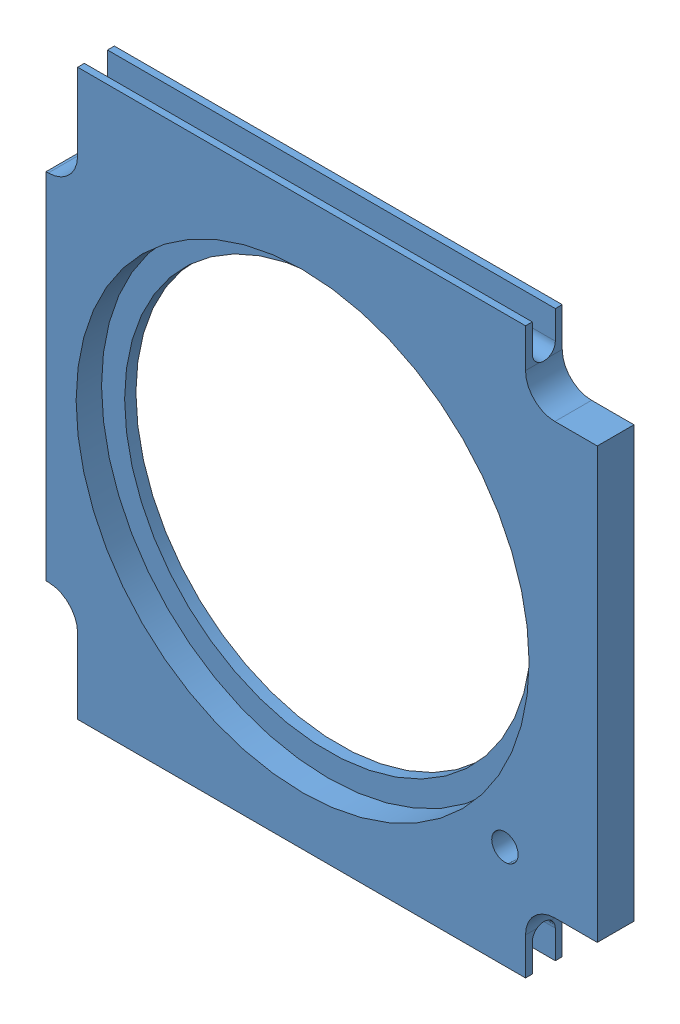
SolidWorks assembly Fixture-undercut-part.SLDASM, configuration No clamps (file format 13000). Lengths in mm.
Overall size (123.95 127 8.26).
13 component instances, 4 part files, 8 mates.
Components (placement in the parent):
- Fixture-undercut-part-1: Fixture-undercut-part.SLDPRT [Default] at (57.186 0 0) x (0 0 1) z (-1 0 0) size (8.26 127 123.95)
- Short-clamp-toe-2: Short-clamp-toe.SLDPRT [Default] at (59.2079 6.7742 10.9361) x (0 1 0) z (0 0 1) size (61.72 24.71 12.45) (suppressed, hidden)
- Short-clamp-toe-4: Short-clamp-toe.SLDPRT [Default] at (59.2177 -2.1506 11.0836) x (0 -1 0) z (0 0 1) size (61.72 24.71 12.45) (suppressed, hidden)
- Short-clamp-wedge-2: Short-clamp-wedge.SLDPRT [Default] at (46.6068 0.0427 -5.5453) x (0 0.038151 0.999272) z (1 0 0) size (29.14 19.72 25.4) (suppressed, hidden)
- Short-clamp-wedge-3: Short-clamp-wedge.SLDPRT [Default] at (72.2619 4.7581 -5.3977) x (0 -0.038151 0.999272) z (-1 0 0) size (29.14 19.72 25.4) (suppressed, hidden)
- Short-clamp-bolt-3: Short-clamp-bolt.SLDPRT [Default] at (-10.9915 73.142 23.3821) size (13.89 13.89 76.2) (suppressed, hidden)
- Short-clamp-bolt-4: Short-clamp-bolt.SLDPRT [Default] at (-11.4778 -66.3426 23.5296) size (13.89 13.89 76.2) (suppressed, hidden)
- Short-clamp-toe-1: Short-clamp-toe.SLDPRT [Default] at (63.63 1.5156 8.3277) size (61.72 24.71 12.45) (suppressed, hidden)
- Short-clamp-toe-3: Short-clamp-toe.SLDPRT [Default] at (57.6843 1.1605 8.431) x (-0.999962 0.008727 0) z (0 0 1) size (61.72 24.71 12.45) (suppressed, hidden)
- Short-clamp-wedge-1: Short-clamp-wedge.SLDPRT [Default] at (62.4804 -11.1414 -6.5623) x (-0.038151 0 0.999272) z (0 1 0) size (29.14 19.72 25.4) (suppressed, hidden)
- Short-clamp-wedge-4: Short-clamp-wedge.SLDPRT [Default] at (58.9859 14.2162 -6.5221) x (0.03812 -0.004212 0.999264) z (-0.006342 -0.999972 -0.003973) size (29.14 19.72 25.4) (suppressed, hidden)
- Short-clamp-bolt-1: Short-clamp-bolt.SLDPRT [Default] at (-79.0962 1.7202 20.877) size (13.89 13.89 76.2) (suppressed, hidden)
- Short-clamp-bolt-2: Short-clamp-bolt.SLDPRT [Default] at (57.0997 2.0951 20.7737) size (13.89 13.89 76.2) (suppressed, hidden)
Mates (geometry in assembly coordinates):
- Coincident3: coincident anti-aligned: plane of Short-clamp-toe-3 through (-46.7775 -10.2854 20.0702) normal (-0.857411 0.007483 -0.514578); plane of Short-clamp-wedge-4 through (-50.7738 -10.6204 26.724) normal (0.857411 -0.007483 0.514578)
- Coincident4: coincident anti-aligned: plane of Short-clamp-toe-4 through (71.5748 -106.5086 22.7228) normal (0 -0.857444 -0.514578); plane of Short-clamp-wedge-2 through (72.0068 -109.5571 27.8025) normal (0 0.857444 0.514578)
- Coincident5: coincident anti-aligned: plane of Short-clamp-toe-1 through (167.988 13.8727 19.9668) normal (0.857444 0 -0.514578); plane of Short-clamp-wedge-1 through (172.0801 14.2586 26.7855) normal (-0.857444 0 0.514578)
- Coincident6: coincident anti-aligned: plane of Short-clamp-toe-2 through (46.8508 111.1321 22.5752) normal (0 0.857444 -0.514578); plane of Short-clamp-wedge-3 through (46.8619 114.3578 27.9502) normal (0 -0.857444 0.514578)
- Coincident7: coincident anti-aligned: plane of Short-clamp-toe-4 through (59.2177 -2.1506 23.5296) normal (0 0 1); plane of Short-clamp-bolt-4 through (58.6971 -66.3426 23.5296) normal (0 0 -1)
- Coincident8: coincident anti-aligned: plane of Short-clamp-toe-3 through (57.6843 1.1605 20.877) normal (0 0 1); plane of Short-clamp-bolt-1 through (-8.9214 1.7202 20.877) normal (0 0 -1)
- Coincident9: coincident anti-aligned: plane of Short-clamp-toe-2 through (59.2079 6.7742 23.3821) normal (0 0 1); plane of Short-clamp-bolt-3 through (59.1834 73.142 23.3821) normal (0 0 -1)
- Coincident10: coincident anti-aligned: plane of Short-clamp-toe-1 through (63.63 1.5156 20.7737) normal (0 0 1); plane of Short-clamp-bolt-2 through (127.2745 2.0951 20.7737) normal (0 0 -1)
